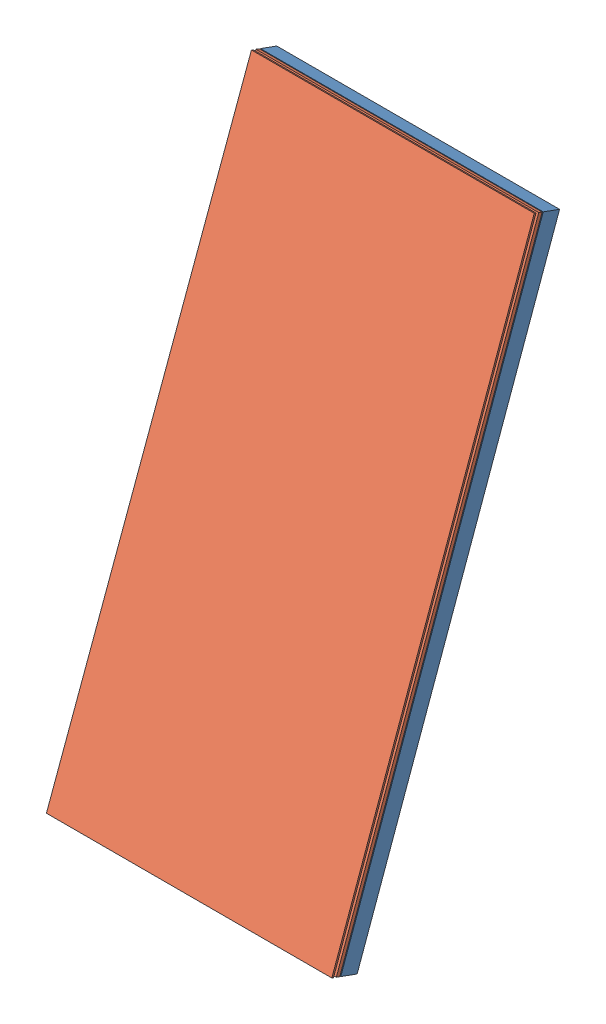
SolidWorks assembly Assem1.SLDASM, configuration Standard (file format 4400). Lengths in mm.
Overall size (1621.57 3104.27 1249.7).
2 component instances, 2 part files, 9 mates.
Components (placement in the parent):
- Steelframe-1: Steelframe.SLDPRT [Standard] at origin size (1557 3086.49 1200.83)
- Glass-1: Glass.sldprt [Default] at origin size (1557 3069.73 1154.79)
Mates (geometry in assembly coordinates):
- InPlace1: in place: plane of ? through (0 0 0) normal (0 0 1); moOrthogonalPlaneRef_w of ? through (0 0 0) normal (0 1 0); plane of ? through (0 0 0) normal (1 0 0); unknown of ?
- Coincident1: coincident aligned: plane of Glass-1; plane of assembly
- Coincident2: coincident aligned: plane of ? through (0 0 0) normal (0 1 0)
- Coincident3: coincident anti-aligned: plane of ? through (0 0 0) normal (1 0 0); unknown of ?
- PLANE1: unknown = 10 mm: plane of ? through (1550 3053.9939 -1111.5629) normal (0.999998 0.002024 -0.000737)
- PLANE2: unknown = 10 mm: plane of ? through (7.5214 3281.4689 -1194.357) normal (-0.999998 0.002024 -0.000737)
- Axis2: unknown = 10 mm: plane of ? through (82.5214 3281.4689 -1194.357) normal (0 0.34202 0.939693); plane of assembly through (-10 0.0202 -0.0074) normal (-0.999998 0.002024 -0.000737)
- Skizze1: unknown = 49.1355 mm: unknown of ?; unknown of ?
- Achse1: unknown: plane of ? through (1557 0 0) normal (0 -0.939693 0.34202)
